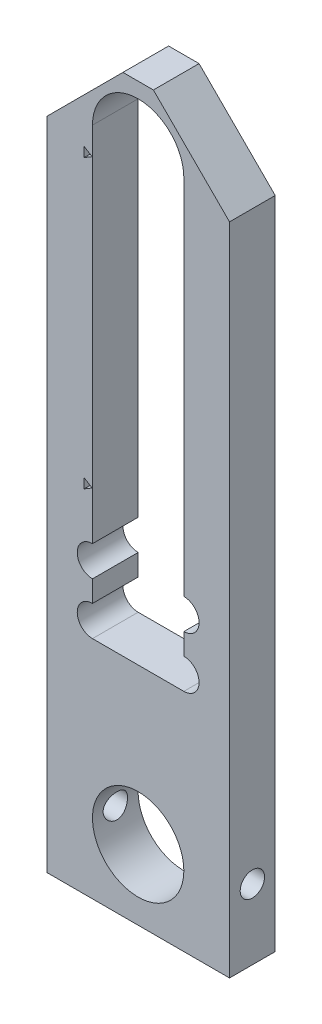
from build123d import *

# Parameters (mm, degrees)
BASE_EXTRUSION_DEPTH       = 15
ESQUISSE2_R                = 15
ENL_V_MAT_EXTRU_1_DEPTH    = 15
ENL_V_MAT_EXTRU_2_DEPTH    = 15
ESQUISSE4_R                = 4
ENL_V_MAT_EXTRU_3_DEPTH    = 248.840674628
ENL_V_MAT_EXTRU_4_DEPTH    = 248.840674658
R_P_TITION_LIN_AIRE1_COUNT = 2
R_P_TITION_LIN_AIRE1_PITCH = 94.21


with BuildPart() as part:
    # Esquisse1 → Base-Extrusion (new body)
    with BuildSketch(Plane.XY):
        Polygon((0, 215), (25, 240), (35, 240), (60, 215), (60, 0), (0, 0), align=None)
    extrude(amount=BASE_EXTRUSION_DEPTH)

    # Esquisse2 → Enl_v. mat.-Extru.1 (cut)
    with BuildSketch(Plane.XY.offset(15)):
        with Locations((30, 23)):
            Circle(ESQUISSE2_R)
    extrude(amount=-ENL_V_MAT_EXTRU_1_DEPTH, mode=Mode.SUBTRACT)

    # Esquisse3 → Enl_v. mat.-Extru.2 (cut)
    with BuildSketch(Plane.XY.offset(15)):
        with BuildLine():
            Line((45, 91), (45, 84))
            ThreePointArc((45, 84), (50, 79), (45, 74))
            Line((45, 74), (15, 74))
            ThreePointArc((15, 74), (10, 79), (15, 84))
            Line((15, 84), (15, 91))
            ThreePointArc((15, 91), (10, 96), (15, 101))
            Line((15, 101), (15, 220))
            ThreePointArc((15, 220), (30, 235), (45, 220))
            Line((45, 220), (45, 101))
            ThreePointArc((45, 101), (50, 96), (45, 91))
        make_face()
    extrude(amount=-ENL_V_MAT_EXTRU_2_DEPTH, mode=Mode.SUBTRACT)

    # Esquisse4 → Enl_v. mat.-Extru.3 (cut, through all)
    with BuildSketch(Plane.ZY):
        with Locations((7.5, 23)):
            Circle(ESQUISSE4_R)
    extrude(amount=-ENL_V_MAT_EXTRU_3_DEPTH, mode=Mode.SUBTRACT)

    # Esquisse5 → Enl_v. mat.-Extru.4 (cut, through all)
    with BuildSketch(Plane.XY.offset(15)):
        Polygon((14.902218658, 116.777944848), (12.23927057, 118.377944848), (12.23927057, 115.177944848), align=None)
    enl_v_mat_extru_4 = extrude(amount=-ENL_V_MAT_EXTRU_4_DEPTH, mode=Mode.SUBTRACT)

    # R_p_tition lin_aire1: Enl_v. mat.-Extru.4 ×2
    with Locations(*[(0, i * R_P_TITION_LIN_AIRE1_PITCH, 0) for i in range(1, R_P_TITION_LIN_AIRE1_COUNT)]):
        add(enl_v_mat_extru_4, mode=Mode.SUBTRACT)


solid = part.part
